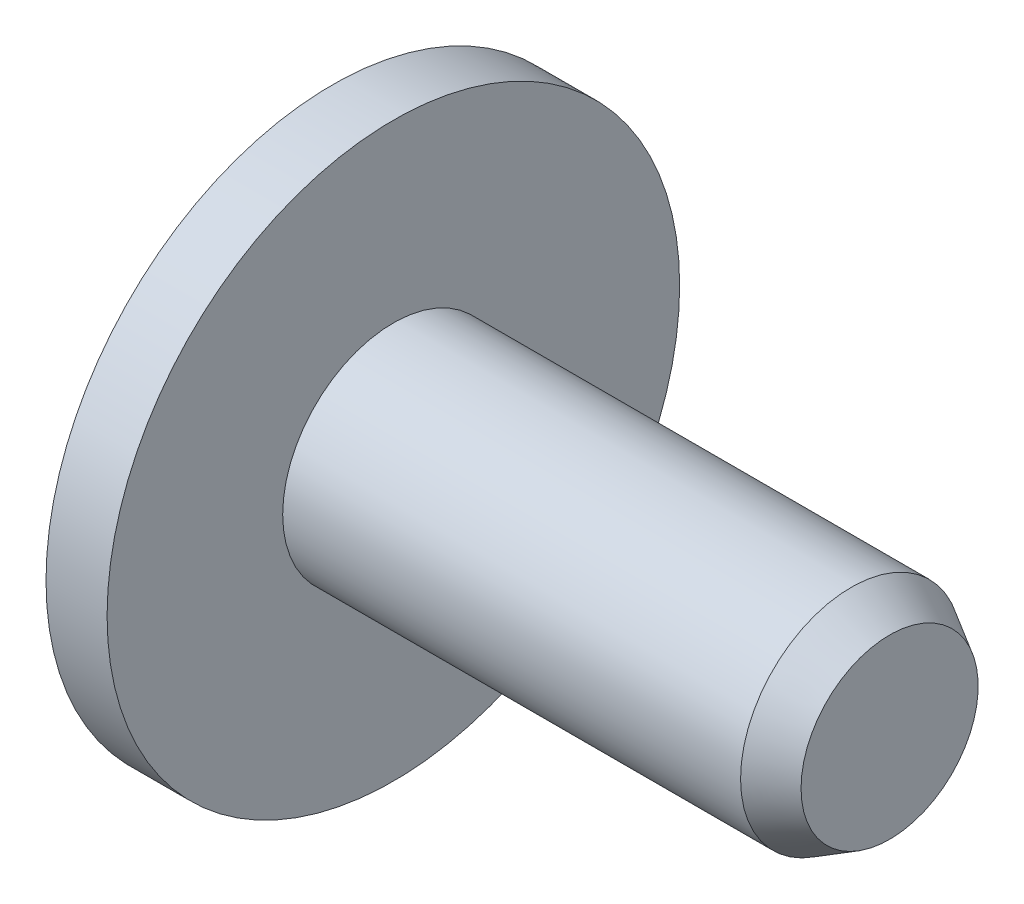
ISO-10303-21;
HEADER;
FILE_DESCRIPTION(('STEP AP214'),'2;1');
FILE_NAME('part.step','',(''),(''),'','','');
FILE_SCHEMA(('AUTOMOTIVE_DESIGN { 1 0 10303 214 1 1 1 1 }'));
ENDSEC;
DATA;
#1=APPLICATION_CONTEXT('core data for automotive mechanical design processes');
#2=APPLICATION_PROTOCOL_DEFINITION('international standard','automotive_design',2000,#1);
#3=PRODUCT_CONTEXT('',#1,'mechanical');
#4=PRODUCT('Part','Part','',(#3));
#5=PRODUCT_RELATED_PRODUCT_CATEGORY('part','',(#4));
#6=PRODUCT_DEFINITION_FORMATION('','',#4);
#7=PRODUCT_DEFINITION_CONTEXT('part definition',#1,'design');
#8=PRODUCT_DEFINITION('design','',#6,#7);
#9=PRODUCT_DEFINITION_SHAPE('','',#8);
#10=(LENGTH_UNIT() NAMED_UNIT(*) SI_UNIT(.MILLI.,.METRE.));
#11=(NAMED_UNIT(*) PLANE_ANGLE_UNIT() SI_UNIT($,.RADIAN.));
#12=(NAMED_UNIT(*) SI_UNIT($,.STERADIAN.) SOLID_ANGLE_UNIT());
#13=UNCERTAINTY_MEASURE_WITH_UNIT(LENGTH_MEASURE(1.E-05),#10,'distance_accuracy_value','');
#14=(GEOMETRIC_REPRESENTATION_CONTEXT(3) GLOBAL_UNCERTAINTY_ASSIGNED_CONTEXT((#13)) GLOBAL_UNIT_ASSIGNED_CONTEXT((#10,
#11,#12)) REPRESENTATION_CONTEXT('',''));
#15=CARTESIAN_POINT('',(0.,0.,0.));
#16=DIRECTION('',(0.,0.,1.));
#17=DIRECTION('',(1.,0.,0.));
#18=AXIS2_PLACEMENT_3D('',#15,#16,#17);
#19=CARTESIAN_POINT('',(1.45,0.,0.));
#20=DIRECTION('',(-1.,0.,0.));
#21=DIRECTION('',(0.,1.,0.));
#22=AXIS2_PLACEMENT_3D('',#19,#20,#21);
#23=SPHERICAL_SURFACE('',#22,3.8);
#24=CARTESIAN_POINT('',(-0.8,0.,0.));
#25=DIRECTION('',(-1.,0.,0.));
#26=DIRECTION('',(0.,0.,1.));
#27=AXIS2_PLACEMENT_3D('',#24,#25,#26);
#28=CIRCLE('',#27,3.06227039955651);
#29=CARTESIAN_POINT('',(-0.8,0.,3.06227039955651));
#30=VERTEX_POINT('',#29);
#31=EDGE_CURVE('E413',#30,#30,#28,.T.);
#32=ORIENTED_EDGE('',*,*,#31,.T.);
#33=EDGE_LOOP('',(#32));
#34=FACE_BOUND('',#33,.T.);
#35=CARTESIAN_POINT('',(1.41774282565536,0.,0.229521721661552));
#36=DIRECTION('',(-0.139173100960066,0.,0.99026806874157));
#37=DIRECTION('',(0.99026806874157,0.,0.139173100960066));
#38=AXIS2_PLACEMENT_3D('',#35,#36,#37);
#39=CIRCLE('',#38,3.7929248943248);
#40=CARTESIAN_POINT('',(-2.2999332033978,-0.540530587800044,-0.292963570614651));
#41=VERTEX_POINT('',#40);
#42=CARTESIAN_POINT('',(-2.10131302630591,-1.32586750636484,-0.265049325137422));
#43=VERTEX_POINT('',#42);
#44=EDGE_CURVE('E226',#41,#43,#39,.T.);
#45=ORIENTED_EDGE('',*,*,#44,.F.);
#46=CARTESIAN_POINT('',(-2.2999332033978,-0.540530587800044,-0.292963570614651));
#47=CARTESIAN_POINT('',(-2.30191974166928,-0.526609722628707,-0.293230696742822));
#48=CARTESIAN_POINT('',(-2.30373167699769,-0.512691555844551,-0.294695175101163));
#49=CARTESIAN_POINT('',(-2.30696239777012,-0.485257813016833,-0.29992369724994));
#50=CARTESIAN_POINT('',(-2.30838148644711,-0.471741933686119,-0.303685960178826));
#51=CARTESIAN_POINT('',(-2.31078635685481,-0.445480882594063,-0.313417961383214));
#52=CARTESIAN_POINT('',(-2.31177192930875,-0.432736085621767,-0.319388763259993));
#53=CARTESIAN_POINT('',(-2.31328125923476,-0.408387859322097,-0.333363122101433));
#54=CARTESIAN_POINT('',(-2.313805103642,-0.396784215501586,-0.341366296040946));
#55=CARTESIAN_POINT('',(-2.31437626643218,-0.37504547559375,-0.359179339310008));
#56=CARTESIAN_POINT('',(-2.31442360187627,-0.364910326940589,-0.368989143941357));
#57=CARTESIAN_POINT('',(-2.31404038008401,-0.346393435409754,-0.390139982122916));
#58=CARTESIAN_POINT('',(-2.31360971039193,-0.338012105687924,-0.401481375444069));
#59=CARTESIAN_POINT('',(-2.31228260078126,-0.323242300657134,-0.425372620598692));
#60=CARTESIAN_POINT('',(-2.3113860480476,-0.316854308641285,-0.437922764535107));
#61=CARTESIAN_POINT('',(-2.30915247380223,-0.306258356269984,-0.463870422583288));
#62=CARTESIAN_POINT('',(-2.30781577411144,-0.302048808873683,-0.477267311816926));
#63=CARTESIAN_POINT('',(-2.30535789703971,-0.297150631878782,-0.499058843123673));
#64=CARTESIAN_POINT('',(-2.30436452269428,-0.295727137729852,-0.507309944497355));
#65=CARTESIAN_POINT('',(-2.3022456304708,-0.293717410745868,-0.523883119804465));
#66=CARTESIAN_POINT('',(-2.30112032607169,-0.293129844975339,-0.532205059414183));
#67=CARTESIAN_POINT('',(-2.29993320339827,-0.292963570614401,-0.54053058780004));
#68=B_SPLINE_CURVE_WITH_KNOTS('',3,(#46,#47,#48,#49,#50,#51,#52,#53,#54,#55,#56,#57,#58,#59,#60,
#61,#62,#63,#64,#65,#66,#67),.UNSPECIFIED.,.F.,.F.,(4,2,2,2,2,2,2,2,2,2,4),(0.,
0.0421372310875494,0.0842418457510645,0.12636676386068,0.168483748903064,0.210599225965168,
0.252724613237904,0.294860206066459,0.336965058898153,0.362221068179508,0.387436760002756),.UNSPECIFIED.);
#69=CARTESIAN_POINT('',(-2.2999332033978,-0.292963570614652,-0.540530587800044));
#70=VERTEX_POINT('',#69);
#71=EDGE_CURVE('E266',#41,#70,#68,.T.);
#72=ORIENTED_EDGE('',*,*,#71,.T.);
#73=CARTESIAN_POINT('',(1.41774282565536,0.229521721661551,0.));
#74=DIRECTION('',(-0.139173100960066,0.99026806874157,0.));
#75=DIRECTION('',(-0.99026806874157,-0.139173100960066,0.));
#76=AXIS2_PLACEMENT_3D('',#73,#74,#75);
#77=CIRCLE('',#76,3.7929248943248);
#78=CARTESIAN_POINT('',(-2.10131302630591,-0.265049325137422,-1.32586750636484));
#79=VERTEX_POINT('',#78);
#80=EDGE_CURVE('E223',#79,#70,#77,.T.);
#81=ORIENTED_EDGE('',*,*,#80,.F.);
#82=CARTESIAN_POINT('',(0.904607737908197,0.,0.778900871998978));
#83=DIRECTION('',(-0.573576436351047,0.,0.819152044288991));
#84=DIRECTION('',(0.819152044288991,0.,0.573576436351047));
#85=AXIS2_PLACEMENT_3D('',#82,#83,#84);
#86=CIRCLE('',#85,3.67911140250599);
#87=CARTESIAN_POINT('',(-2.10131302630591,0.265049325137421,-1.32586750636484));
#88=VERTEX_POINT('',#87);
#89=EDGE_CURVE('E188',#88,#79,#86,.T.);
#90=ORIENTED_EDGE('',*,*,#89,.F.);
#91=CARTESIAN_POINT('',(1.41774282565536,-0.229521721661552,0.));
#92=DIRECTION('',(-0.139173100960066,-0.99026806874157,0.));
#93=DIRECTION('',(0.99026806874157,-0.139173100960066,0.));
#94=AXIS2_PLACEMENT_3D('',#91,#92,#93);
#95=CIRCLE('',#94,3.7929248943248);
#96=CARTESIAN_POINT('',(-2.2999332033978,0.292963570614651,-0.540530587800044));
#97=VERTEX_POINT('',#96);
#98=EDGE_CURVE('E186',#97,#88,#95,.T.);
#99=ORIENTED_EDGE('',*,*,#98,.F.);
#100=CARTESIAN_POINT('',(-2.2999332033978,0.292963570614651,-0.540530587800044));
#101=CARTESIAN_POINT('',(-2.30191974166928,0.293230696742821,-0.526609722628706));
#102=CARTESIAN_POINT('',(-2.30373167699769,0.294695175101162,-0.51269155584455));
#103=CARTESIAN_POINT('',(-2.30696239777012,0.299923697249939,-0.485257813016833));
#104=CARTESIAN_POINT('',(-2.30838148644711,0.303685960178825,-0.471741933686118));
#105=CARTESIAN_POINT('',(-2.31078635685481,0.313417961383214,-0.445480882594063));
#106=CARTESIAN_POINT('',(-2.31177192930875,0.319388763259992,-0.432736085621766));
#107=CARTESIAN_POINT('',(-2.31328125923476,0.333363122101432,-0.408387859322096));
#108=CARTESIAN_POINT('',(-2.313805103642,0.341366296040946,-0.396784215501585));
#109=CARTESIAN_POINT('',(-2.31437626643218,0.359179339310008,-0.375045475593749));
#110=CARTESIAN_POINT('',(-2.31442360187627,0.368989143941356,-0.364910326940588));
#111=CARTESIAN_POINT('',(-2.31404038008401,0.390139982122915,-0.346393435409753));
#112=CARTESIAN_POINT('',(-2.31360971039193,0.401481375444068,-0.338012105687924));
#113=CARTESIAN_POINT('',(-2.31228260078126,0.425372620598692,-0.323242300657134));
#114=CARTESIAN_POINT('',(-2.3113860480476,0.437922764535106,-0.316854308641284));
#115=CARTESIAN_POINT('',(-2.30915247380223,0.463870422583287,-0.306258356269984));
#116=CARTESIAN_POINT('',(-2.30781577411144,0.477267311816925,-0.302048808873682));
#117=CARTESIAN_POINT('',(-2.30535789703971,0.499058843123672,-0.297150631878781));
#118=CARTESIAN_POINT('',(-2.30436452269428,0.507309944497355,-0.295727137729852));
#119=CARTESIAN_POINT('',(-2.3022456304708,0.523883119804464,-0.293717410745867));
#120=CARTESIAN_POINT('',(-2.30112032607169,0.532205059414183,-0.293129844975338));
#121=CARTESIAN_POINT('',(-2.29993320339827,0.54053058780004,-0.2929635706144));
#122=B_SPLINE_CURVE_WITH_KNOTS('',3,(#100,#101,#102,#103,#104,#105,#106,#107,#108,#109,#110,
#111,#112,#113,#114,#115,#116,#117,#118,#119,#120,#121),.UNSPECIFIED.,.F.,.F.,(4,2,2,2,2,2,2,2,
2,2,4),(0.,0.0421372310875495,0.0842418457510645,0.12636676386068,0.168483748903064,
0.210599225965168,0.252724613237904,0.294860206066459,0.336965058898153,0.362221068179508,
0.387436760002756),.UNSPECIFIED.);
#123=CARTESIAN_POINT('',(-2.2999332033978,0.540530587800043,-0.292963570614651));
#124=VERTEX_POINT('',#123);
#125=EDGE_CURVE('E168',#97,#124,#122,.T.);
#126=ORIENTED_EDGE('',*,*,#125,.T.);
#127=CARTESIAN_POINT('',(1.41774282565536,0.,0.229521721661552));
#128=DIRECTION('',(-0.139173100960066,0.,0.99026806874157));
#129=DIRECTION('',(0.99026806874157,0.,0.139173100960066));
#130=AXIS2_PLACEMENT_3D('',#127,#128,#129);
#131=CIRCLE('',#130,3.7929248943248);
#132=CARTESIAN_POINT('',(-2.10131302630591,1.32586750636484,-0.265049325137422));
#133=VERTEX_POINT('',#132);
#134=EDGE_CURVE('E158',#133,#124,#131,.T.);
#135=ORIENTED_EDGE('',*,*,#134,.F.);
#136=CARTESIAN_POINT('',(0.904607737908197,-0.778900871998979,0.));
#137=DIRECTION('',(-0.573576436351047,-0.819152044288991,0.));
#138=DIRECTION('',(0.819152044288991,-0.573576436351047,0.));
#139=AXIS2_PLACEMENT_3D('',#136,#137,#138);
#140=CIRCLE('',#139,3.67911140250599);
#141=CARTESIAN_POINT('',(-2.10131302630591,1.32586750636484,0.265049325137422));
#142=VERTEX_POINT('',#141);
#143=EDGE_CURVE('E149',#142,#133,#140,.T.);
#144=ORIENTED_EDGE('',*,*,#143,.F.);
#145=CARTESIAN_POINT('',(1.41774282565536,0.,-0.229521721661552));
#146=DIRECTION('',(-0.139173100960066,0.,-0.99026806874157));
#147=DIRECTION('',(-0.99026806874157,0.,0.139173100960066));
#148=AXIS2_PLACEMENT_3D('',#145,#146,#147);
#149=CIRCLE('',#148,3.7929248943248);
#150=CARTESIAN_POINT('',(-2.2999332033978,0.540530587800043,0.292963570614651));
#151=VERTEX_POINT('',#150);
#152=EDGE_CURVE('E159',#151,#142,#149,.T.);
#153=ORIENTED_EDGE('',*,*,#152,.F.);
#154=CARTESIAN_POINT('',(-2.2999332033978,0.540530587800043,0.292963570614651));
#155=CARTESIAN_POINT('',(-2.30191974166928,0.526609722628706,0.293230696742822));
#156=CARTESIAN_POINT('',(-2.30373167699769,0.512691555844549,0.294695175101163));
#157=CARTESIAN_POINT('',(-2.30696239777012,0.485257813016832,0.29992369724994));
#158=CARTESIAN_POINT('',(-2.30838148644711,0.471741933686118,0.303685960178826));
#159=CARTESIAN_POINT('',(-2.31078635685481,0.445480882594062,0.313417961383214));
#160=CARTESIAN_POINT('',(-2.31177192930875,0.432736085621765,0.319388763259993));
#161=CARTESIAN_POINT('',(-2.31328125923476,0.408387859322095,0.333363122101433));
#162=CARTESIAN_POINT('',(-2.313805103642,0.396784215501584,0.341366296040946));
#163=CARTESIAN_POINT('',(-2.31437626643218,0.375045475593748,0.359179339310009));
#164=CARTESIAN_POINT('',(-2.31442360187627,0.364910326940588,0.368989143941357));
#165=CARTESIAN_POINT('',(-2.31404038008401,0.346393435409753,0.390139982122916));
#166=CARTESIAN_POINT('',(-2.31360971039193,0.338012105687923,0.401481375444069));
#167=CARTESIAN_POINT('',(-2.31228260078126,0.323242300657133,0.425372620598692));
#168=CARTESIAN_POINT('',(-2.3113860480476,0.316854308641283,0.437922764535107));
#169=CARTESIAN_POINT('',(-2.30915247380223,0.306258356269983,0.463870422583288));
#170=CARTESIAN_POINT('',(-2.30781577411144,0.302048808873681,0.477267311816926));
#171=CARTESIAN_POINT('',(-2.30535789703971,0.297150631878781,0.499058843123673));
#172=CARTESIAN_POINT('',(-2.30436452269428,0.295727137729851,0.507309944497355));
#173=CARTESIAN_POINT('',(-2.3022456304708,0.293717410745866,0.523883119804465));
#174=CARTESIAN_POINT('',(-2.30112032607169,0.293129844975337,0.532205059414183));
#175=CARTESIAN_POINT('',(-2.29993320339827,0.292963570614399,0.540530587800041));
#176=B_SPLINE_CURVE_WITH_KNOTS('',3,(#154,#155,#156,#157,#158,#159,#160,#161,#162,#163,#164,
#165,#166,#167,#168,#169,#170,#171,#172,#173,#174,#175),.UNSPECIFIED.,.F.,.F.,(4,2,2,2,2,2,2,2,
2,2,4),(0.,0.0421372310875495,0.0842418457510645,0.12636676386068,0.168483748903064,
0.210599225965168,0.252724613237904,0.294860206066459,0.336965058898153,0.362221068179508,
0.387436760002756),.UNSPECIFIED.);
#177=CARTESIAN_POINT('',(-2.2999332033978,0.292963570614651,0.540530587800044));
#178=VERTEX_POINT('',#177);
#179=EDGE_CURVE('E242',#151,#178,#176,.T.);
#180=ORIENTED_EDGE('',*,*,#179,.T.);
#181=CARTESIAN_POINT('',(1.41774282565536,-0.229521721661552,0.));
#182=DIRECTION('',(-0.139173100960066,-0.99026806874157,0.));
#183=DIRECTION('',(0.99026806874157,-0.139173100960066,0.));
#184=AXIS2_PLACEMENT_3D('',#181,#182,#183);
#185=CIRCLE('',#184,3.7929248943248);
#186=CARTESIAN_POINT('',(-2.10131302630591,0.265049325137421,1.32586750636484));
#187=VERTEX_POINT('',#186);
#188=EDGE_CURVE('E190',#187,#178,#185,.T.);
#189=ORIENTED_EDGE('',*,*,#188,.F.);
#190=CARTESIAN_POINT('',(0.904607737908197,0.,-0.778900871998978));
#191=DIRECTION('',(-0.573576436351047,0.,-0.819152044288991));
#192=DIRECTION('',(-0.819152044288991,0.,0.573576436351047));
#193=AXIS2_PLACEMENT_3D('',#190,#191,#192);
#194=CIRCLE('',#193,3.67911140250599);
#195=CARTESIAN_POINT('',(-2.10131302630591,-0.265049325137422,1.32586750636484));
#196=VERTEX_POINT('',#195);
#197=EDGE_CURVE('E193',#196,#187,#194,.T.);
#198=ORIENTED_EDGE('',*,*,#197,.F.);
#199=CARTESIAN_POINT('',(1.41774282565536,0.229521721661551,0.));
#200=DIRECTION('',(-0.139173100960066,0.99026806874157,0.));
#201=DIRECTION('',(-0.99026806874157,-0.139173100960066,0.));
#202=AXIS2_PLACEMENT_3D('',#199,#200,#201);
#203=CIRCLE('',#202,3.7929248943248);
#204=CARTESIAN_POINT('',(-2.29993320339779,-0.292963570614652,0.540530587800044));
#205=VERTEX_POINT('',#204);
#206=EDGE_CURVE('E209',#205,#196,#203,.T.);
#207=ORIENTED_EDGE('',*,*,#206,.F.);
#208=CARTESIAN_POINT('',(-2.2999332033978,-0.292963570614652,0.540530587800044));
#209=CARTESIAN_POINT('',(-2.30191974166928,-0.293230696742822,0.526609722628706));
#210=CARTESIAN_POINT('',(-2.30373167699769,-0.294695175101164,0.51269155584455));
#211=CARTESIAN_POINT('',(-2.30696239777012,-0.29992369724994,0.485257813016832));
#212=CARTESIAN_POINT('',(-2.30838148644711,-0.303685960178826,0.471741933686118));
#213=CARTESIAN_POINT('',(-2.31078635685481,-0.313417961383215,0.445480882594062));
#214=CARTESIAN_POINT('',(-2.31177192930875,-0.319388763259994,0.432736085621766));
#215=CARTESIAN_POINT('',(-2.31328125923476,-0.333363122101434,0.408387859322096));
#216=CARTESIAN_POINT('',(-2.313805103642,-0.341366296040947,0.396784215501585));
#217=CARTESIAN_POINT('',(-2.31437626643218,-0.359179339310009,0.375045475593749));
#218=CARTESIAN_POINT('',(-2.31442360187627,-0.368989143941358,0.364910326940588));
#219=CARTESIAN_POINT('',(-2.31404038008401,-0.390139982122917,0.346393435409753));
#220=CARTESIAN_POINT('',(-2.31360971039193,-0.40148137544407,0.338012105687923));
#221=CARTESIAN_POINT('',(-2.31228260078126,-0.425372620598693,0.323242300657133));
#222=CARTESIAN_POINT('',(-2.3113860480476,-0.437922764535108,0.316854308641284));
#223=CARTESIAN_POINT('',(-2.30915247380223,-0.463870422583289,0.306258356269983));
#224=CARTESIAN_POINT('',(-2.30781577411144,-0.477267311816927,0.302048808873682));
#225=CARTESIAN_POINT('',(-2.30535789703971,-0.499058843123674,0.297150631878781));
#226=CARTESIAN_POINT('',(-2.30436452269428,-0.507309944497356,0.295727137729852));
#227=CARTESIAN_POINT('',(-2.3022456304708,-0.523883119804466,0.293717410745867));
#228=CARTESIAN_POINT('',(-2.30112032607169,-0.532205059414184,0.293129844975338));
#229=CARTESIAN_POINT('',(-2.29993320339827,-0.540530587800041,0.2929635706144));
#230=B_SPLINE_CURVE_WITH_KNOTS('',3,(#208,#209,#210,#211,#212,#213,#214,#215,#216,#217,#218,
#219,#220,#221,#222,#223,#224,#225,#226,#227,#228,#229),.UNSPECIFIED.,.F.,.F.,(4,2,2,2,2,2,2,2,
2,2,4),(0.,0.0421372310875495,0.0842418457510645,0.12636676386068,0.168483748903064,
0.210599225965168,0.252724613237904,0.294860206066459,0.336965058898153,0.362221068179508,
0.387436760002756),.UNSPECIFIED.);
#231=CARTESIAN_POINT('',(-2.2999332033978,-0.540530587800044,0.292963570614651));
#232=VERTEX_POINT('',#231);
#233=EDGE_CURVE('E261',#205,#232,#230,.T.);
#234=ORIENTED_EDGE('',*,*,#233,.T.);
#235=CARTESIAN_POINT('',(1.41774282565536,0.,-0.229521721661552));
#236=DIRECTION('',(-0.139173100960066,0.,-0.99026806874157));
#237=DIRECTION('',(-0.99026806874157,0.,0.139173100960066));
#238=AXIS2_PLACEMENT_3D('',#235,#236,#237);
#239=CIRCLE('',#238,3.7929248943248);
#240=CARTESIAN_POINT('',(-2.10131302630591,-1.32586750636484,0.265049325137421));
#241=VERTEX_POINT('',#240);
#242=EDGE_CURVE('E206',#241,#232,#239,.T.);
#243=ORIENTED_EDGE('',*,*,#242,.F.);
#244=CARTESIAN_POINT('',(0.904607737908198,0.778900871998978,0.));
#245=DIRECTION('',(-0.573576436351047,0.819152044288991,0.));
#246=DIRECTION('',(-0.819152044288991,-0.573576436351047,0.));
#247=AXIS2_PLACEMENT_3D('',#244,#245,#246);
#248=CIRCLE('',#247,3.67911140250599);
#249=EDGE_CURVE('E174',#43,#241,#248,.T.);
#250=ORIENTED_EDGE('',*,*,#249,.F.);
#251=EDGE_LOOP('',(#45,#72,#81,#90,#99,#126,#135,#144,#153,#180,#189,#198,#207,#234,#243,#250));
#252=FACE_BOUND('',#251,.T.);
#253=ADVANCED_FACE('F34',(#34,#252),#23,.T.);
#254=CARTESIAN_POINT('',(-6.47830998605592,0.,0.));
#255=DIRECTION('',(-1.,0.,0.));
#256=DIRECTION('',(0.,0.,1.));
#257=AXIS2_PLACEMENT_3D('',#254,#255,#256);
#258=CYLINDRICAL_SURFACE('',#257,3.75);
#259=CARTESIAN_POINT('',(-0.8,0.,0.));
#260=DIRECTION('',(-1.,0.,0.));
#261=DIRECTION('',(0.,0.,1.));
#262=AXIS2_PLACEMENT_3D('',#259,#260,#261);
#263=CIRCLE('',#262,3.75);
#264=CARTESIAN_POINT('',(-0.8,0.,3.75));
#265=VERTEX_POINT('',#264);
#266=EDGE_CURVE('E406',#265,#265,#263,.T.);
#267=ORIENTED_EDGE('',*,*,#266,.F.);
#268=EDGE_LOOP('',(#267));
#269=FACE_BOUND('',#268,.T.);
#270=CARTESIAN_POINT('',(0.,0.,0.));
#271=DIRECTION('',(-1.,0.,0.));
#272=DIRECTION('',(0.,0.,1.));
#273=AXIS2_PLACEMENT_3D('',#270,#271,#272);
#274=CIRCLE('',#273,3.75);
#275=CARTESIAN_POINT('',(0.,0.,3.75));
#276=VERTEX_POINT('',#275);
#277=EDGE_CURVE('E164',#276,#276,#274,.T.);
#278=ORIENTED_EDGE('',*,*,#277,.T.);
#279=EDGE_LOOP('',(#278));
#280=FACE_BOUND('',#279,.T.);
#281=ADVANCED_FACE('F251',(#269,#280),#258,.T.);
#282=CARTESIAN_POINT('',(-0.8,3.75,0.));
#283=DIRECTION('',(1.,0.,0.));
#284=DIRECTION('',(0.,0.,-1.));
#285=AXIS2_PLACEMENT_3D('',#282,#283,#284);
#286=PLANE('',#285);
#287=ORIENTED_EDGE('',*,*,#31,.F.);
#288=EDGE_LOOP('',(#287));
#289=FACE_BOUND('',#288,.T.);
#290=ORIENTED_EDGE('',*,*,#266,.T.);
#291=EDGE_LOOP('',(#290));
#292=FACE_BOUND('',#291,.T.);
#293=ADVANCED_FACE('F255',(#289,#292),#286,.F.);
#294=CARTESIAN_POINT('',(6.5,1.45,0.));
#295=DIRECTION('',(-1.,0.,0.));
#296=DIRECTION('',(0.,0.,1.));
#297=AXIS2_PLACEMENT_3D('',#294,#295,#296);
#298=PLANE('',#297);
#299=CARTESIAN_POINT('',(6.5,0.,0.));
#300=DIRECTION('',(-1.,0.,0.));
#301=DIRECTION('',(0.,0.,1.));
#302=AXIS2_PLACEMENT_3D('',#299,#300,#301);
#303=CIRCLE('',#302,1.16);
#304=CARTESIAN_POINT('',(6.5,0.,1.16));
#305=VERTEX_POINT('',#304);
#306=EDGE_CURVE('E189',#305,#305,#303,.F.);
#307=ORIENTED_EDGE('',*,*,#306,.T.);
#308=EDGE_LOOP('',(#307));
#309=FACE_BOUND('',#308,.T.);
#310=ADVANCED_FACE('F253',(#309),#298,.F.);
#311=CARTESIAN_POINT('',(-6.47830998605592,0.,0.));
#312=DIRECTION('',(-1.,0.,0.));
#313=DIRECTION('',(0.,0.,1.));
#314=AXIS2_PLACEMENT_3D('',#311,#312,#313);
#315=CYLINDRICAL_SURFACE('',#314,1.45);
#316=CARTESIAN_POINT('',(5.99770526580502,0.,0.));
#317=DIRECTION('',(-1.,0.,0.));
#318=DIRECTION('',(0.,0.,1.));
#319=AXIS2_PLACEMENT_3D('',#316,#317,#318);
#320=CIRCLE('',#319,1.45);
#321=CARTESIAN_POINT('',(5.99770526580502,0.,1.45));
#322=VERTEX_POINT('',#321);
#323=EDGE_CURVE('E418',#322,#322,#320,.T.);
#324=ORIENTED_EDGE('',*,*,#323,.T.);
#325=EDGE_LOOP('',(#324));
#326=FACE_BOUND('',#325,.T.);
#327=CARTESIAN_POINT('',(0.,0.,0.));
#328=DIRECTION('',(-1.,0.,0.));
#329=DIRECTION('',(0.,0.,1.));
#330=AXIS2_PLACEMENT_3D('',#327,#328,#329);
#331=CIRCLE('',#330,1.45);
#332=CARTESIAN_POINT('',(0.,0.,1.45));
#333=VERTEX_POINT('',#332);
#334=EDGE_CURVE('E410',#333,#333,#331,.T.);
#335=ORIENTED_EDGE('',*,*,#334,.F.);
#336=EDGE_LOOP('',(#335));
#337=FACE_BOUND('',#336,.T.);
#338=ADVANCED_FACE('F427',(#326,#337),#315,.T.);
#339=CARTESIAN_POINT('',(0.,3.75,0.));
#340=DIRECTION('',(-1.,0.,0.));
#341=DIRECTION('',(0.,0.,1.));
#342=AXIS2_PLACEMENT_3D('',#339,#340,#341);
#343=PLANE('',#342);
#344=ORIENTED_EDGE('',*,*,#277,.F.);
#345=EDGE_LOOP('',(#344));
#346=FACE_BOUND('',#345,.T.);
#347=ORIENTED_EDGE('',*,*,#334,.T.);
#348=EDGE_LOOP('',(#347));
#349=FACE_BOUND('',#348,.T.);
#350=ADVANCED_FACE('F395',(#346,#349),#343,.F.);
#351=CARTESIAN_POINT('',(5.99770526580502,0.,0.));
#352=DIRECTION('',(-1.,0.,0.));
#353=DIRECTION('',(0.,0.,1.));
#354=AXIS2_PLACEMENT_3D('',#351,#352,#353);
#355=CONICAL_SURFACE('',#354,1.45,0.523598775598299);
#356=ORIENTED_EDGE('',*,*,#306,.F.);
#357=EDGE_LOOP('',(#356));
#358=FACE_BOUND('',#357,.T.);
#359=ORIENTED_EDGE('',*,*,#323,.F.);
#360=EDGE_LOOP('',(#359));
#361=FACE_BOUND('',#360,.T.);
#362=ADVANCED_FACE('F387',(#358,#361),#355,.T.);
#363=CARTESIAN_POINT('',(-2.35,0.,-0.3));
#364=DIRECTION('',(-0.139173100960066,0.,0.99026806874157));
#365=DIRECTION('',(0.99026806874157,0.,0.139173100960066));
#366=AXIS2_PLACEMENT_3D('',#363,#364,#365);
#367=PLANE('',#366);
#368=ORIENTED_EDGE('',*,*,#134,.T.);
#369=DIRECTION('',(-0.980814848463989,0.137844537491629,-0.137844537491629));
#370=VECTOR('',#369,1.);
#371=CARTESIAN_POINT('',(-2.27596895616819,0.53716263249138,-0.289595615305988));
#372=LINE('',#371,#370);
#373=CARTESIAN_POINT('',(-0.77,0.325512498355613,-0.0779454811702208));
#374=VERTEX_POINT('',#373);
#375=EDGE_CURVE('E50',#124,#374,#372,.F.);
#376=ORIENTED_EDGE('',*,*,#375,.T.);
#377=DIRECTION('',(0.,1.,0.));
#378=VECTOR('',#377,1.);
#379=CARTESIAN_POINT('',(-0.77,-0.3,-0.0779454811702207));
#380=LINE('',#379,#378);
#381=CARTESIAN_POINT('',(-0.77,0.393672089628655,-0.0779454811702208));
#382=VERTEX_POINT('',#381);
#383=EDGE_CURVE('E162',#374,#382,#380,.T.);
#384=ORIENTED_EDGE('',*,*,#383,.T.);
#385=DIRECTION('',(-0.813777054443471,0.569812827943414,-0.114368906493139));
#386=VECTOR('',#385,1.);
#387=CARTESIAN_POINT('',(-2.32207876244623,1.4804493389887,-0.296075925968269));
#388=LINE('',#387,#386);
#389=EDGE_CURVE('E152',#382,#133,#388,.T.);
#390=ORIENTED_EDGE('',*,*,#389,.T.);
#391=EDGE_LOOP('',(#368,#376,#384,#390));
#392=FACE_BOUND('',#391,.T.);
#393=ADVANCED_FACE('F161',(#392),#367,.T.);
#394=CARTESIAN_POINT('',(-2.35,1.5,0.));
#395=DIRECTION('',(-0.573576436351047,-0.819152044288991,0.));
#396=DIRECTION('',(0.819152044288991,-0.573576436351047,0.));
#397=AXIS2_PLACEMENT_3D('',#394,#395,#396);
#398=PLANE('',#397);
#399=ORIENTED_EDGE('',*,*,#143,.T.);
#400=ORIENTED_EDGE('',*,*,#389,.F.);
#401=DIRECTION('',(0.,0.,1.));
#402=VECTOR('',#401,1.);
#403=CARTESIAN_POINT('',(-0.77,0.393672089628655,-0.3));
#404=LINE('',#403,#402);
#405=CARTESIAN_POINT('',(-0.77,0.393672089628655,0.0779454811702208));
#406=VERTEX_POINT('',#405);
#407=EDGE_CURVE('E178',#382,#406,#404,.T.);
#408=ORIENTED_EDGE('',*,*,#407,.T.);
#409=DIRECTION('',(-0.813777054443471,0.569812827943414,0.114368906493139));
#410=VECTOR('',#409,1.);
#411=CARTESIAN_POINT('',(-1.65444909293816,1.01297001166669,0.202246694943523));
#412=LINE('',#411,#410);
#413=EDGE_CURVE('E154',#406,#142,#412,.T.);
#414=ORIENTED_EDGE('',*,*,#413,.T.);
#415=EDGE_LOOP('',(#399,#400,#408,#414));
#416=FACE_BOUND('',#415,.T.);
#417=ADVANCED_FACE('F151',(#416),#398,.T.);
#418=CARTESIAN_POINT('',(-2.35,0.,0.3));
#419=DIRECTION('',(-0.139173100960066,0.,-0.99026806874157));
#420=DIRECTION('',(-0.99026806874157,0.,0.139173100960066));
#421=AXIS2_PLACEMENT_3D('',#418,#419,#420);
#422=PLANE('',#421);
#423=DIRECTION('',(0.,-1.,0.));
#424=VECTOR('',#423,1.);
#425=CARTESIAN_POINT('',(-0.77,-0.300000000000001,0.0779454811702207));
#426=LINE('',#425,#424);
#427=CARTESIAN_POINT('',(-0.77,0.325512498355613,0.0779454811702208));
#428=VERTEX_POINT('',#427);
#429=EDGE_CURVE('E201',#406,#428,#426,.T.);
#430=ORIENTED_EDGE('',*,*,#429,.T.);
#431=DIRECTION('',(-0.980814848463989,0.137844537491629,0.137844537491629));
#432=VECTOR('',#431,1.);
#433=CARTESIAN_POINT('',(-2.27596895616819,0.53716263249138,0.289595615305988));
#434=LINE('',#433,#432);
#435=EDGE_CURVE('E292',#428,#151,#434,.T.);
#436=ORIENTED_EDGE('',*,*,#435,.T.);
#437=ORIENTED_EDGE('',*,*,#152,.T.);
#438=ORIENTED_EDGE('',*,*,#413,.F.);
#439=EDGE_LOOP('',(#430,#436,#437,#438));
#440=FACE_BOUND('',#439,.T.);
#441=ADVANCED_FACE('F364',(#440),#422,.T.);
#442=CARTESIAN_POINT('',(-2.35,0.299999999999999,0.));
#443=DIRECTION('',(-0.139173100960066,-0.99026806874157,0.));
#444=DIRECTION('',(0.99026806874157,-0.139173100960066,0.));
#445=AXIS2_PLACEMENT_3D('',#442,#443,#444);
#446=PLANE('',#445);
#447=ORIENTED_EDGE('',*,*,#188,.T.);
#448=DIRECTION('',(-0.980814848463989,0.137844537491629,0.137844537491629));
#449=VECTOR('',#448,1.);
#450=CARTESIAN_POINT('',(-2.27596895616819,0.289595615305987,0.53716263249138));
#451=LINE('',#450,#449);
#452=CARTESIAN_POINT('',(-0.77,0.0779454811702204,0.325512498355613));
#453=VERTEX_POINT('',#452);
#454=EDGE_CURVE('E290',#178,#453,#451,.F.);
#455=ORIENTED_EDGE('',*,*,#454,.T.);
#456=DIRECTION('',(0.,0.,1.));
#457=VECTOR('',#456,1.);
#458=CARTESIAN_POINT('',(-0.77,0.0779454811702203,-0.3));
#459=LINE('',#458,#457);
#460=CARTESIAN_POINT('',(-0.77,0.0779454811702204,0.393672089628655));
#461=VERTEX_POINT('',#460);
#462=EDGE_CURVE('E198',#453,#461,#459,.T.);
#463=ORIENTED_EDGE('',*,*,#462,.T.);
#464=DIRECTION('',(-0.813777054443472,0.114368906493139,0.569812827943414));
#465=VECTOR('',#464,1.);
#466=CARTESIAN_POINT('',(-2.32207876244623,0.296075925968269,1.4804493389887));
#467=LINE('',#466,#465);
#468=EDGE_CURVE('E194',#461,#187,#467,.T.);
#469=ORIENTED_EDGE('',*,*,#468,.T.);
#470=EDGE_LOOP('',(#447,#455,#463,#469));
#471=FACE_BOUND('',#470,.T.);
#472=ADVANCED_FACE('F366',(#471),#446,.T.);
#473=CARTESIAN_POINT('',(-2.35,0.,1.5));
#474=DIRECTION('',(-0.573576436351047,0.,-0.819152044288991));
#475=DIRECTION('',(-0.819152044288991,0.,0.573576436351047));
#476=AXIS2_PLACEMENT_3D('',#473,#474,#475);
#477=PLANE('',#476);
#478=ORIENTED_EDGE('',*,*,#197,.T.);
#479=ORIENTED_EDGE('',*,*,#468,.F.);
#480=DIRECTION('',(0.,-1.,0.));
#481=VECTOR('',#480,1.);
#482=CARTESIAN_POINT('',(-0.77,-0.300000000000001,0.393672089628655));
#483=LINE('',#482,#481);
#484=CARTESIAN_POINT('',(-0.77,-0.0779454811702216,0.393672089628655));
#485=VERTEX_POINT('',#484);
#486=EDGE_CURVE('E200',#461,#485,#483,.T.);
#487=ORIENTED_EDGE('',*,*,#486,.T.);
#488=DIRECTION('',(-0.813777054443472,-0.114368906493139,0.569812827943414));
#489=VECTOR('',#488,1.);
#490=CARTESIAN_POINT('',(-1.65444909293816,-0.202246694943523,1.01297001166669));
#491=LINE('',#490,#489);
#492=EDGE_CURVE('E197',#485,#196,#491,.T.);
#493=ORIENTED_EDGE('',*,*,#492,.T.);
#494=EDGE_LOOP('',(#478,#479,#487,#493));
#495=FACE_BOUND('',#494,.T.);
#496=ADVANCED_FACE('F347',(#495),#477,.T.);
#497=CARTESIAN_POINT('',(-2.35,-0.300000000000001,0.));
#498=DIRECTION('',(-0.139173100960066,0.99026806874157,0.));
#499=DIRECTION('',(-0.99026806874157,-0.139173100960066,0.));
#500=AXIS2_PLACEMENT_3D('',#497,#498,#499);
#501=PLANE('',#500);
#502=DIRECTION('',(0.,0.,-1.));
#503=VECTOR('',#502,1.);
#504=CARTESIAN_POINT('',(-0.77,-0.0779454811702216,-0.3));
#505=LINE('',#504,#503);
#506=CARTESIAN_POINT('',(-0.77,-0.0779454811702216,0.325512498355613));
#507=VERTEX_POINT('',#506);
#508=EDGE_CURVE('E217',#485,#507,#505,.T.);
#509=ORIENTED_EDGE('',*,*,#508,.T.);
#510=DIRECTION('',(-0.980814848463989,-0.137844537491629,0.137844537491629));
#511=VECTOR('',#510,1.);
#512=CARTESIAN_POINT('',(-2.27596895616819,-0.289595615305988,0.53716263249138));
#513=LINE('',#512,#511);
#514=EDGE_CURVE('E308',#507,#205,#513,.T.);
#515=ORIENTED_EDGE('',*,*,#514,.T.);
#516=ORIENTED_EDGE('',*,*,#206,.T.);
#517=ORIENTED_EDGE('',*,*,#492,.F.);
#518=EDGE_LOOP('',(#509,#515,#516,#517));
#519=FACE_BOUND('',#518,.T.);
#520=ADVANCED_FACE('F344',(#519),#501,.T.);
#521=CARTESIAN_POINT('',(-2.35,0.,0.3));
#522=DIRECTION('',(-0.139173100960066,0.,-0.99026806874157));
#523=DIRECTION('',(-0.99026806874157,0.,0.139173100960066));
#524=AXIS2_PLACEMENT_3D('',#521,#522,#523);
#525=PLANE('',#524);
#526=ORIENTED_EDGE('',*,*,#242,.T.);
#527=DIRECTION('',(-0.980814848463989,-0.137844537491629,0.137844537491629));
#528=VECTOR('',#527,1.);
#529=CARTESIAN_POINT('',(-2.27596895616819,-0.537162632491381,0.289595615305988));
#530=LINE('',#529,#528);
#531=CARTESIAN_POINT('',(-0.77,-0.325512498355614,0.0779454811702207));
#532=VERTEX_POINT('',#531);
#533=EDGE_CURVE('E306',#232,#532,#530,.F.);
#534=ORIENTED_EDGE('',*,*,#533,.T.);
#535=DIRECTION('',(0.,-1.,0.));
#536=VECTOR('',#535,1.);
#537=CARTESIAN_POINT('',(-0.77,-0.300000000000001,0.0779454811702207));
#538=LINE('',#537,#536);
#539=CARTESIAN_POINT('',(-0.77,-0.393672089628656,0.0779454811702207));
#540=VERTEX_POINT('',#539);
#541=EDGE_CURVE('E214',#532,#540,#538,.T.);
#542=ORIENTED_EDGE('',*,*,#541,.T.);
#543=DIRECTION('',(-0.813777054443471,-0.569812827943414,0.114368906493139));
#544=VECTOR('',#543,1.);
#545=CARTESIAN_POINT('',(-2.32207876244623,-1.48044933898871,0.296075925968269));
#546=LINE('',#545,#544);
#547=EDGE_CURVE('E210',#540,#241,#546,.T.);
#548=ORIENTED_EDGE('',*,*,#547,.T.);
#549=EDGE_LOOP('',(#526,#534,#542,#548));
#550=FACE_BOUND('',#549,.T.);
#551=ADVANCED_FACE('F336',(#550),#525,.T.);
#552=CARTESIAN_POINT('',(-2.35,-1.5,0.));
#553=DIRECTION('',(-0.573576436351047,0.819152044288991,0.));
#554=DIRECTION('',(-0.819152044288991,-0.573576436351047,0.));
#555=AXIS2_PLACEMENT_3D('',#552,#553,#554);
#556=PLANE('',#555);
#557=ORIENTED_EDGE('',*,*,#249,.T.);
#558=ORIENTED_EDGE('',*,*,#547,.F.);
#559=DIRECTION('',(0.,0.,-1.));
#560=VECTOR('',#559,1.);
#561=CARTESIAN_POINT('',(-0.77,-0.393672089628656,-0.3));
#562=LINE('',#561,#560);
#563=CARTESIAN_POINT('',(-0.77,-0.393672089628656,-0.0779454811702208));
#564=VERTEX_POINT('',#563);
#565=EDGE_CURVE('E216',#540,#564,#562,.T.);
#566=ORIENTED_EDGE('',*,*,#565,.T.);
#567=DIRECTION('',(-0.813777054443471,-0.569812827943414,-0.114368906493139));
#568=VECTOR('',#567,1.);
#569=CARTESIAN_POINT('',(-1.65444909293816,-1.01297001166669,-0.202246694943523));
#570=LINE('',#569,#568);
#571=EDGE_CURVE('E213',#564,#43,#570,.T.);
#572=ORIENTED_EDGE('',*,*,#571,.T.);
#573=EDGE_LOOP('',(#557,#558,#566,#572));
#574=FACE_BOUND('',#573,.T.);
#575=ADVANCED_FACE('F330',(#574),#556,.T.);
#576=CARTESIAN_POINT('',(-2.35,0.,-0.3));
#577=DIRECTION('',(-0.139173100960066,0.,0.99026806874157));
#578=DIRECTION('',(0.99026806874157,0.,0.139173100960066));
#579=AXIS2_PLACEMENT_3D('',#576,#577,#578);
#580=PLANE('',#579);
#581=DIRECTION('',(0.,1.,0.));
#582=VECTOR('',#581,1.);
#583=CARTESIAN_POINT('',(-0.77,-0.300000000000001,-0.0779454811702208));
#584=LINE('',#583,#582);
#585=CARTESIAN_POINT('',(-0.77,-0.325512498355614,-0.0779454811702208));
#586=VERTEX_POINT('',#585);
#587=EDGE_CURVE('E231',#564,#586,#584,.T.);
#588=ORIENTED_EDGE('',*,*,#587,.T.);
#589=DIRECTION('',(-0.980814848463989,-0.137844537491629,-0.137844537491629));
#590=VECTOR('',#589,1.);
#591=CARTESIAN_POINT('',(-2.27596895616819,-0.537162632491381,-0.289595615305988));
#592=LINE('',#591,#590);
#593=EDGE_CURVE('E169',#586,#41,#592,.T.);
#594=ORIENTED_EDGE('',*,*,#593,.T.);
#595=ORIENTED_EDGE('',*,*,#44,.T.);
#596=ORIENTED_EDGE('',*,*,#571,.F.);
#597=EDGE_LOOP('',(#588,#594,#595,#596));
#598=FACE_BOUND('',#597,.T.);
#599=ADVANCED_FACE('F328',(#598),#580,.T.);
#600=CARTESIAN_POINT('',(-2.35,-0.3,0.));
#601=DIRECTION('',(-0.139173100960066,0.99026806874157,0.));
#602=DIRECTION('',(-0.99026806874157,-0.139173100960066,0.));
#603=AXIS2_PLACEMENT_3D('',#600,#601,#602);
#604=PLANE('',#603);
#605=ORIENTED_EDGE('',*,*,#80,.T.);
#606=DIRECTION('',(-0.980814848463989,-0.137844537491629,-0.137844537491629));
#607=VECTOR('',#606,1.);
#608=CARTESIAN_POINT('',(-2.27596895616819,-0.289595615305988,-0.53716263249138));
#609=LINE('',#608,#607);
#610=CARTESIAN_POINT('',(-0.77,-0.0779454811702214,-0.325512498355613));
#611=VERTEX_POINT('',#610);
#612=EDGE_CURVE('E310',#70,#611,#609,.F.);
#613=ORIENTED_EDGE('',*,*,#612,.T.);
#614=DIRECTION('',(0.,0.,-1.));
#615=VECTOR('',#614,1.);
#616=CARTESIAN_POINT('',(-0.77,-0.0779454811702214,-0.3));
#617=LINE('',#616,#615);
#618=CARTESIAN_POINT('',(-0.77,-0.0779454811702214,-0.393672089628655));
#619=VERTEX_POINT('',#618);
#620=EDGE_CURVE('E229',#611,#619,#617,.T.);
#621=ORIENTED_EDGE('',*,*,#620,.T.);
#622=DIRECTION('',(-0.813777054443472,-0.114368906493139,-0.569812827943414));
#623=VECTOR('',#622,1.);
#624=CARTESIAN_POINT('',(-2.32207876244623,-0.29607592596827,-1.4804493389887));
#625=LINE('',#624,#623);
#626=EDGE_CURVE('E185',#619,#79,#625,.T.);
#627=ORIENTED_EDGE('',*,*,#626,.T.);
#628=EDGE_LOOP('',(#605,#613,#621,#627));
#629=FACE_BOUND('',#628,.T.);
#630=ADVANCED_FACE('F319',(#629),#604,.T.);
#631=CARTESIAN_POINT('',(-2.35,0.,-1.5));
#632=DIRECTION('',(-0.573576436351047,0.,0.819152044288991));
#633=DIRECTION('',(0.819152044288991,0.,0.573576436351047));
#634=AXIS2_PLACEMENT_3D('',#631,#632,#633);
#635=PLANE('',#634);
#636=ORIENTED_EDGE('',*,*,#89,.T.);
#637=ORIENTED_EDGE('',*,*,#626,.F.);
#638=DIRECTION('',(0.,1.,0.));
#639=VECTOR('',#638,1.);
#640=CARTESIAN_POINT('',(-0.77,-0.300000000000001,-0.393672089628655));
#641=LINE('',#640,#639);
#642=CARTESIAN_POINT('',(-0.77,0.0779454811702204,-0.393672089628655));
#643=VERTEX_POINT('',#642);
#644=EDGE_CURVE('E182',#619,#643,#641,.T.);
#645=ORIENTED_EDGE('',*,*,#644,.T.);
#646=DIRECTION('',(-0.813777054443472,0.114368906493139,-0.569812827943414));
#647=VECTOR('',#646,1.);
#648=CARTESIAN_POINT('',(-1.65444909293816,0.202246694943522,-1.01297001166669));
#649=LINE('',#648,#647);
#650=EDGE_CURVE('E181',#643,#88,#649,.T.);
#651=ORIENTED_EDGE('',*,*,#650,.T.);
#652=EDGE_LOOP('',(#636,#637,#645,#651));
#653=FACE_BOUND('',#652,.T.);
#654=ADVANCED_FACE('F353',(#653),#635,.T.);
#655=CARTESIAN_POINT('',(-2.35,0.299999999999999,0.));
#656=DIRECTION('',(-0.139173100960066,-0.99026806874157,0.));
#657=DIRECTION('',(0.99026806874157,-0.139173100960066,0.));
#658=AXIS2_PLACEMENT_3D('',#655,#656,#657);
#659=PLANE('',#658);
#660=DIRECTION('',(0.,0.,1.));
#661=VECTOR('',#660,1.);
#662=CARTESIAN_POINT('',(-0.77,0.0779454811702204,-0.3));
#663=LINE('',#662,#661);
#664=CARTESIAN_POINT('',(-0.77,0.0779454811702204,-0.325512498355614));
#665=VERTEX_POINT('',#664);
#666=EDGE_CURVE('E179',#643,#665,#663,.T.);
#667=ORIENTED_EDGE('',*,*,#666,.T.);
#668=DIRECTION('',(-0.980814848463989,0.137844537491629,-0.137844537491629));
#669=VECTOR('',#668,1.);
#670=CARTESIAN_POINT('',(-2.27596895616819,0.289595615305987,-0.537162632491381));
#671=LINE('',#670,#669);
#672=EDGE_CURVE('E301',#665,#97,#671,.T.);
#673=ORIENTED_EDGE('',*,*,#672,.T.);
#674=ORIENTED_EDGE('',*,*,#98,.T.);
#675=ORIENTED_EDGE('',*,*,#650,.F.);
#676=EDGE_LOOP('',(#667,#673,#674,#675));
#677=FACE_BOUND('',#676,.T.);
#678=ADVANCED_FACE('F356',(#677),#659,.T.);
#679=CARTESIAN_POINT('',(-0.77,-0.300000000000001,-0.3));
#680=DIRECTION('',(-1.,0.,0.));
#681=DIRECTION('',(0.,0.,1.));
#682=AXIS2_PLACEMENT_3D('',#679,#680,#681);
#683=PLANE('',#682);
#684=ORIENTED_EDGE('',*,*,#383,.F.);
#685=CARTESIAN_POINT('',(-0.77,0.330402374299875,-0.330402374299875));
#686=DIRECTION('',(-1.,0.,0.));
#687=DIRECTION('',(0.,0.707106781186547,-0.707106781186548));
#688=AXIS2_PLACEMENT_3D('',#685,#686,#687);
#689=ELLIPSE('',#688,0.254890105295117,0.25);
#690=EDGE_CURVE('E11',#374,#665,#689,.F.);
#691=ORIENTED_EDGE('',*,*,#690,.T.);
#692=ORIENTED_EDGE('',*,*,#666,.F.);
#693=ORIENTED_EDGE('',*,*,#644,.F.);
#694=ORIENTED_EDGE('',*,*,#620,.F.);
#695=CARTESIAN_POINT('',(-0.77,-0.330402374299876,-0.330402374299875));
#696=DIRECTION('',(-1.,0.,0.));
#697=DIRECTION('',(0.,-0.707106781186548,-0.707106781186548));
#698=AXIS2_PLACEMENT_3D('',#695,#696,#697);
#699=ELLIPSE('',#698,0.254890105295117,0.25);
#700=EDGE_CURVE('E296',#611,#586,#699,.F.);
#701=ORIENTED_EDGE('',*,*,#700,.T.);
#702=ORIENTED_EDGE('',*,*,#587,.F.);
#703=ORIENTED_EDGE('',*,*,#565,.F.);
#704=ORIENTED_EDGE('',*,*,#541,.F.);
#705=CARTESIAN_POINT('',(-0.77,-0.330402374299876,0.330402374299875));
#706=DIRECTION('',(-1.,0.,0.));
#707=DIRECTION('',(0.,-0.707106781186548,0.707106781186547));
#708=AXIS2_PLACEMENT_3D('',#705,#706,#707);
#709=ELLIPSE('',#708,0.254890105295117,0.25);
#710=EDGE_CURVE('E295',#532,#507,#709,.F.);
#711=ORIENTED_EDGE('',*,*,#710,.T.);
#712=ORIENTED_EDGE('',*,*,#508,.F.);
#713=ORIENTED_EDGE('',*,*,#486,.F.);
#714=ORIENTED_EDGE('',*,*,#462,.F.);
#715=CARTESIAN_POINT('',(-0.77,0.330402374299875,0.330402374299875));
#716=DIRECTION('',(-1.,0.,0.));
#717=DIRECTION('',(0.,0.707106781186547,0.707106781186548));
#718=AXIS2_PLACEMENT_3D('',#715,#716,#717);
#719=ELLIPSE('',#718,0.254890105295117,0.25);
#720=EDGE_CURVE('E43',#453,#428,#719,.F.);
#721=ORIENTED_EDGE('',*,*,#720,.T.);
#722=ORIENTED_EDGE('',*,*,#429,.F.);
#723=ORIENTED_EDGE('',*,*,#407,.F.);
#724=EDGE_LOOP('',(#684,#691,#692,#693,#694,#701,#702,#703,#704,#711,#712,#713,#714,#721,#722,#723));
#725=FACE_BOUND('',#724,.T.);
#726=ADVANCED_FACE('F323',(#725),#683,.T.);
#727=CARTESIAN_POINT('',(-2.24117568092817,-0.537162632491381,-0.53716263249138));
#728=DIRECTION('',(-0.980814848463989,-0.137844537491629,-0.137844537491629));
#729=DIRECTION('',(-0.139173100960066,0.,0.99026806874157));
#730=AXIS2_PLACEMENT_3D('',#727,#728,#729);
#731=CYLINDRICAL_SURFACE('',#730,0.25);
#732=ORIENTED_EDGE('',*,*,#700,.F.);
#733=ORIENTED_EDGE('',*,*,#612,.F.);
#734=ORIENTED_EDGE('',*,*,#71,.F.);
#735=ORIENTED_EDGE('',*,*,#593,.F.);
#736=EDGE_LOOP('',(#732,#733,#734,#735));
#737=FACE_BOUND('',#736,.T.);
#738=ADVANCED_FACE('F276',(#737),#731,.T.);
#739=CARTESIAN_POINT('',(-2.24117568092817,-0.537162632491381,0.53716263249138));
#740=DIRECTION('',(-0.980814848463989,-0.137844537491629,0.137844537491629));
#741=DIRECTION('',(0.139173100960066,-0.99026806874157,0.));
#742=AXIS2_PLACEMENT_3D('',#739,#740,#741);
#743=CYLINDRICAL_SURFACE('',#742,0.25);
#744=ORIENTED_EDGE('',*,*,#710,.F.);
#745=ORIENTED_EDGE('',*,*,#533,.F.);
#746=ORIENTED_EDGE('',*,*,#233,.F.);
#747=ORIENTED_EDGE('',*,*,#514,.F.);
#748=EDGE_LOOP('',(#744,#745,#746,#747));
#749=FACE_BOUND('',#748,.T.);
#750=ADVANCED_FACE('F272',(#749),#743,.T.);
#751=CARTESIAN_POINT('',(-2.24117568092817,0.53716263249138,0.53716263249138));
#752=DIRECTION('',(-0.980814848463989,0.137844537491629,0.137844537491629));
#753=DIRECTION('',(0.139173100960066,0.,0.99026806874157));
#754=AXIS2_PLACEMENT_3D('',#751,#752,#753);
#755=CYLINDRICAL_SURFACE('',#754,0.25);
#756=ORIENTED_EDGE('',*,*,#720,.F.);
#757=ORIENTED_EDGE('',*,*,#454,.F.);
#758=ORIENTED_EDGE('',*,*,#179,.F.);
#759=ORIENTED_EDGE('',*,*,#435,.F.);
#760=EDGE_LOOP('',(#756,#757,#758,#759));
#761=FACE_BOUND('',#760,.T.);
#762=ADVANCED_FACE('F275',(#761),#755,.T.);
#763=CARTESIAN_POINT('',(-2.24117568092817,0.53716263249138,-0.53716263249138));
#764=DIRECTION('',(-0.980814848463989,0.137844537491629,-0.137844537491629));
#765=DIRECTION('',(-0.139173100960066,0.,0.99026806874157));
#766=AXIS2_PLACEMENT_3D('',#763,#764,#765);
#767=CYLINDRICAL_SURFACE('',#766,0.25);
#768=ORIENTED_EDGE('',*,*,#690,.F.);
#769=ORIENTED_EDGE('',*,*,#375,.F.);
#770=ORIENTED_EDGE('',*,*,#125,.F.);
#771=ORIENTED_EDGE('',*,*,#672,.F.);
#772=EDGE_LOOP('',(#768,#769,#770,#771));
#773=FACE_BOUND('',#772,.T.);
#774=ADVANCED_FACE('F36',(#773),#767,.T.);
#775=CLOSED_SHELL('',(#253,#281,#293,#310,#338,#350,#362,#393,#417,#441,#472,#496,#520,#551,
#575,#599,#630,#654,#678,#726,#738,#750,#762,#774));
#776=MANIFOLD_SOLID_BREP('B2',#775);
#777=ADVANCED_BREP_SHAPE_REPRESENTATION('',(#18,#776),#14);
#778=SHAPE_DEFINITION_REPRESENTATION(#9,#777);
ENDSEC;
END-ISO-10303-21;
